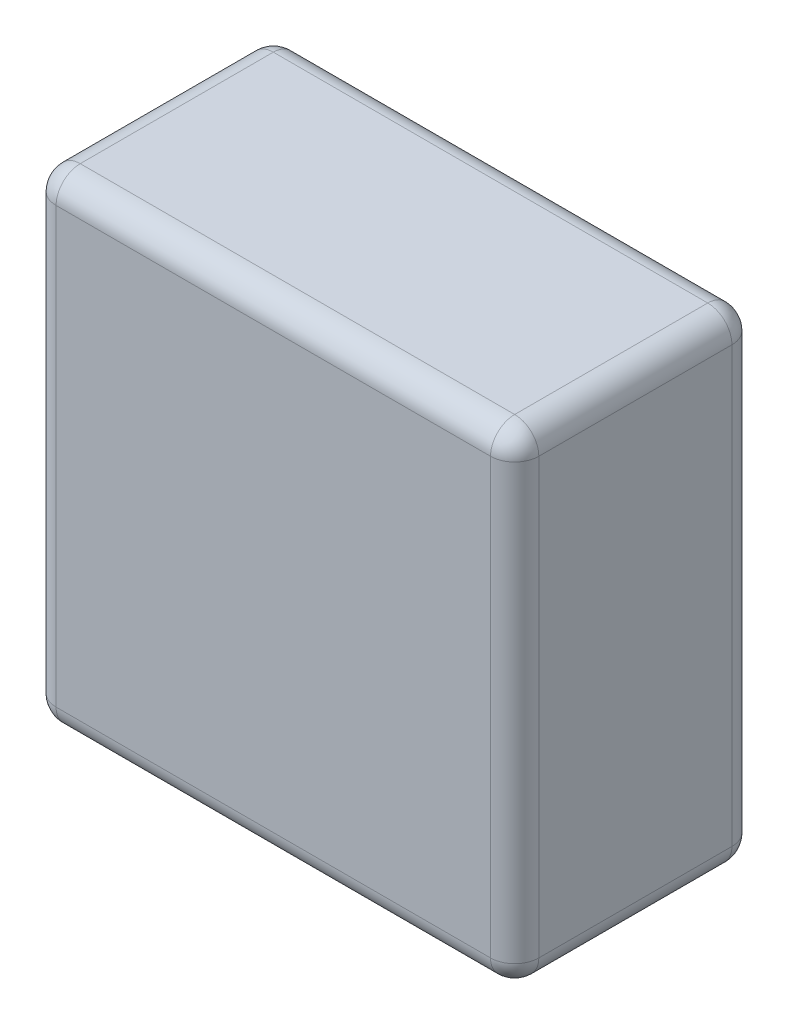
ISO-10303-21;
HEADER;
FILE_DESCRIPTION(('STEP AP214'),'2;1');
FILE_NAME('part.step','',(''),(''),'','','');
FILE_SCHEMA(('AUTOMOTIVE_DESIGN { 1 0 10303 214 1 1 1 1 }'));
ENDSEC;
DATA;
#1=APPLICATION_CONTEXT('core data for automotive mechanical design processes');
#2=APPLICATION_PROTOCOL_DEFINITION('international standard','automotive_design',2000,#1);
#3=PRODUCT_CONTEXT('',#1,'mechanical');
#4=PRODUCT('Part','Part','',(#3));
#5=PRODUCT_RELATED_PRODUCT_CATEGORY('part','',(#4));
#6=PRODUCT_DEFINITION_FORMATION('','',#4);
#7=PRODUCT_DEFINITION_CONTEXT('part definition',#1,'design');
#8=PRODUCT_DEFINITION('design','',#6,#7);
#9=PRODUCT_DEFINITION_SHAPE('','',#8);
#10=(LENGTH_UNIT() NAMED_UNIT(*) SI_UNIT(.MILLI.,.METRE.));
#11=(NAMED_UNIT(*) PLANE_ANGLE_UNIT() SI_UNIT($,.RADIAN.));
#12=(NAMED_UNIT(*) SI_UNIT($,.STERADIAN.) SOLID_ANGLE_UNIT());
#13=UNCERTAINTY_MEASURE_WITH_UNIT(LENGTH_MEASURE(1.E-05),#10,'distance_accuracy_value','');
#14=(GEOMETRIC_REPRESENTATION_CONTEXT(3) GLOBAL_UNCERTAINTY_ASSIGNED_CONTEXT((#13)) GLOBAL_UNIT_ASSIGNED_CONTEXT((#10,
#11,#12)) REPRESENTATION_CONTEXT('',''));
#15=CARTESIAN_POINT('',(0.,0.,0.));
#16=DIRECTION('',(0.,0.,1.));
#17=DIRECTION('',(1.,0.,0.));
#18=AXIS2_PLACEMENT_3D('',#15,#16,#17);
#19=CARTESIAN_POINT('',(-326.4,109.6,100.));
#20=DIRECTION('',(1.,0.,0.));
#21=DIRECTION('',(0.,0.,-1.));
#22=AXIS2_PLACEMENT_3D('',#19,#20,#21);
#23=PLANE('',#22);
#24=DIRECTION('',(0.,-1.,0.));
#25=VECTOR('',#24,1.);
#26=CARTESIAN_POINT('',(-326.4,109.6,9.99999999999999));
#27=LINE('',#26,#25);
#28=CARTESIAN_POINT('',(-326.4,99.6,9.99999999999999));
#29=VERTEX_POINT('',#28);
#30=CARTESIAN_POINT('',(-326.4,-80.4,9.99999999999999));
#31=VERTEX_POINT('',#30);
#32=EDGE_CURVE('E171',#29,#31,#27,.T.);
#33=ORIENTED_EDGE('',*,*,#32,.T.);
#34=DIRECTION('',(0.,0.,-1.));
#35=VECTOR('',#34,1.);
#36=CARTESIAN_POINT('',(-326.4,-80.4,100.));
#37=LINE('',#36,#35);
#38=CARTESIAN_POINT('',(-326.4,-80.4,90.));
#39=VERTEX_POINT('',#38);
#40=EDGE_CURVE('E173',#31,#39,#37,.F.);
#41=ORIENTED_EDGE('',*,*,#40,.T.);
#42=DIRECTION('',(0.,-1.,0.));
#43=VECTOR('',#42,1.);
#44=CARTESIAN_POINT('',(-326.4,109.6,90.));
#45=LINE('',#44,#43);
#46=CARTESIAN_POINT('',(-326.4,99.6,90.));
#47=VERTEX_POINT('',#46);
#48=EDGE_CURVE('E169',#39,#47,#45,.F.);
#49=ORIENTED_EDGE('',*,*,#48,.T.);
#50=DIRECTION('',(0.,0.,-1.));
#51=VECTOR('',#50,1.);
#52=CARTESIAN_POINT('',(-326.4,99.6,100.));
#53=LINE('',#52,#51);
#54=EDGE_CURVE('E167',#47,#29,#53,.T.);
#55=ORIENTED_EDGE('',*,*,#54,.T.);
#56=EDGE_LOOP('',(#33,#41,#49,#55));
#57=FACE_BOUND('',#56,.T.);
#58=ADVANCED_FACE('F33',(#57),#23,.F.);
#59=CARTESIAN_POINT('',(-326.4,-90.4,100.));
#60=DIRECTION('',(0.,1.,0.));
#61=DIRECTION('',(0.,0.,1.));
#62=AXIS2_PLACEMENT_3D('',#59,#60,#61);
#63=PLANE('',#62);
#64=DIRECTION('',(0.,0.,-1.));
#65=VECTOR('',#64,1.);
#66=CARTESIAN_POINT('',(-316.4,-90.4,100.));
#67=LINE('',#66,#65);
#68=CARTESIAN_POINT('',(-316.4,-90.4,90.));
#69=VERTEX_POINT('',#68);
#70=CARTESIAN_POINT('',(-316.4,-90.4,9.99999999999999));
#71=VERTEX_POINT('',#70);
#72=EDGE_CURVE('E154',#69,#71,#67,.T.);
#73=ORIENTED_EDGE('',*,*,#72,.T.);
#74=DIRECTION('',(1.,0.,0.));
#75=VECTOR('',#74,1.);
#76=CARTESIAN_POINT('',(-326.4,-90.4,9.99999999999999));
#77=LINE('',#76,#75);
#78=CARTESIAN_POINT('',(-136.4,-90.4,9.99999999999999));
#79=VERTEX_POINT('',#78);
#80=EDGE_CURVE('E126',#71,#79,#77,.T.);
#81=ORIENTED_EDGE('',*,*,#80,.T.);
#82=DIRECTION('',(0.,0.,-1.));
#83=VECTOR('',#82,1.);
#84=CARTESIAN_POINT('',(-136.4,-90.4,100.));
#85=LINE('',#84,#83);
#86=CARTESIAN_POINT('',(-136.4,-90.4,90.));
#87=VERTEX_POINT('',#86);
#88=EDGE_CURVE('E144',#79,#87,#85,.F.);
#89=ORIENTED_EDGE('',*,*,#88,.T.);
#90=DIRECTION('',(1.,0.,0.));
#91=VECTOR('',#90,1.);
#92=CARTESIAN_POINT('',(-326.4,-90.4,90.));
#93=LINE('',#92,#91);
#94=EDGE_CURVE('E150',#87,#69,#93,.F.);
#95=ORIENTED_EDGE('',*,*,#94,.T.);
#96=EDGE_LOOP('',(#73,#81,#89,#95));
#97=FACE_BOUND('',#96,.T.);
#98=ADVANCED_FACE('F152',(#97),#63,.F.);
#99=CARTESIAN_POINT('',(-126.4,109.6,100.));
#100=DIRECTION('',(-1.,0.,0.));
#101=DIRECTION('',(0.,0.,1.));
#102=AXIS2_PLACEMENT_3D('',#99,#100,#101);
#103=PLANE('',#102);
#104=DIRECTION('',(0.,1.,0.));
#105=VECTOR('',#104,1.);
#106=CARTESIAN_POINT('',(-126.4,-90.4,90.));
#107=LINE('',#106,#105);
#108=CARTESIAN_POINT('',(-126.4,99.6,90.));
#109=VERTEX_POINT('',#108);
#110=CARTESIAN_POINT('',(-126.4,-80.4,90.));
#111=VERTEX_POINT('',#110);
#112=EDGE_CURVE('E189',#109,#111,#107,.F.);
#113=ORIENTED_EDGE('',*,*,#112,.T.);
#114=DIRECTION('',(0.,0.,-1.));
#115=VECTOR('',#114,1.);
#116=CARTESIAN_POINT('',(-126.4,-80.4,100.));
#117=LINE('',#116,#115);
#118=CARTESIAN_POINT('',(-126.4,-80.4,9.99999999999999));
#119=VERTEX_POINT('',#118);
#120=EDGE_CURVE('E191',#111,#119,#117,.T.);
#121=ORIENTED_EDGE('',*,*,#120,.T.);
#122=DIRECTION('',(0.,1.,0.));
#123=VECTOR('',#122,1.);
#124=CARTESIAN_POINT('',(-126.4,109.6,9.99999999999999));
#125=LINE('',#124,#123);
#126=CARTESIAN_POINT('',(-126.4,99.6,9.99999999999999));
#127=VERTEX_POINT('',#126);
#128=EDGE_CURVE('E187',#119,#127,#125,.T.);
#129=ORIENTED_EDGE('',*,*,#128,.T.);
#130=DIRECTION('',(0.,0.,-1.));
#131=VECTOR('',#130,1.);
#132=CARTESIAN_POINT('',(-126.4,99.6,100.));
#133=LINE('',#132,#131);
#134=EDGE_CURVE('E185',#127,#109,#133,.F.);
#135=ORIENTED_EDGE('',*,*,#134,.T.);
#136=EDGE_LOOP('',(#113,#121,#129,#135));
#137=FACE_BOUND('',#136,.T.);
#138=ADVANCED_FACE('F329',(#137),#103,.F.);
#139=CARTESIAN_POINT('',(-326.4,109.6,100.));
#140=DIRECTION('',(0.,-1.,0.));
#141=DIRECTION('',(0.,0.,-1.));
#142=AXIS2_PLACEMENT_3D('',#139,#140,#141);
#143=PLANE('',#142);
#144=DIRECTION('',(-1.,0.,0.));
#145=VECTOR('',#144,1.);
#146=CARTESIAN_POINT('',(-126.4,109.6,90.));
#147=LINE('',#146,#145);
#148=CARTESIAN_POINT('',(-316.4,109.6,90.));
#149=VERTEX_POINT('',#148);
#150=CARTESIAN_POINT('',(-136.4,109.6,90.));
#151=VERTEX_POINT('',#150);
#152=EDGE_CURVE('E42',#149,#151,#147,.F.);
#153=ORIENTED_EDGE('',*,*,#152,.T.);
#154=DIRECTION('',(0.,0.,-1.));
#155=VECTOR('',#154,1.);
#156=CARTESIAN_POINT('',(-136.4,109.6,100.));
#157=LINE('',#156,#155);
#158=CARTESIAN_POINT('',(-136.4,109.6,9.99999999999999));
#159=VERTEX_POINT('',#158);
#160=EDGE_CURVE('E11',#151,#159,#157,.T.);
#161=ORIENTED_EDGE('',*,*,#160,.T.);
#162=DIRECTION('',(-1.,0.,0.));
#163=VECTOR('',#162,1.);
#164=CARTESIAN_POINT('',(-326.4,109.6,9.99999999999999));
#165=LINE('',#164,#163);
#166=CARTESIAN_POINT('',(-316.4,109.6,9.99999999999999));
#167=VERTEX_POINT('',#166);
#168=EDGE_CURVE('E194',#159,#167,#165,.T.);
#169=ORIENTED_EDGE('',*,*,#168,.T.);
#170=DIRECTION('',(0.,0.,-1.));
#171=VECTOR('',#170,1.);
#172=CARTESIAN_POINT('',(-316.4,109.6,100.));
#173=LINE('',#172,#171);
#174=EDGE_CURVE('E53',#167,#149,#173,.F.);
#175=ORIENTED_EDGE('',*,*,#174,.T.);
#176=EDGE_LOOP('',(#153,#161,#169,#175));
#177=FACE_BOUND('',#176,.T.);
#178=ADVANCED_FACE('F295',(#177),#143,.F.);
#179=CARTESIAN_POINT('',(0.,0.,100.));
#180=DIRECTION('',(0.,0.,1.));
#181=DIRECTION('',(1.,0.,0.));
#182=AXIS2_PLACEMENT_3D('',#179,#180,#181);
#183=PLANE('',#182);
#184=DIRECTION('',(0.,-1.,0.));
#185=VECTOR('',#184,1.);
#186=CARTESIAN_POINT('',(-316.4,-90.4,100.));
#187=LINE('',#186,#185);
#188=CARTESIAN_POINT('',(-316.4,99.6,100.));
#189=VERTEX_POINT('',#188);
#190=CARTESIAN_POINT('',(-316.4,-80.4,100.));
#191=VERTEX_POINT('',#190);
#192=EDGE_CURVE('E180',#189,#191,#187,.T.);
#193=ORIENTED_EDGE('',*,*,#192,.T.);
#194=DIRECTION('',(1.,0.,0.));
#195=VECTOR('',#194,1.);
#196=CARTESIAN_POINT('',(-126.4,-80.4,100.));
#197=LINE('',#196,#195);
#198=CARTESIAN_POINT('',(-136.4,-80.4,100.));
#199=VERTEX_POINT('',#198);
#200=EDGE_CURVE('E182',#191,#199,#197,.T.);
#201=ORIENTED_EDGE('',*,*,#200,.T.);
#202=DIRECTION('',(0.,1.,0.));
#203=VECTOR('',#202,1.);
#204=CARTESIAN_POINT('',(-136.4,109.6,100.));
#205=LINE('',#204,#203);
#206=CARTESIAN_POINT('',(-136.4,99.6,100.));
#207=VERTEX_POINT('',#206);
#208=EDGE_CURVE('E178',#199,#207,#205,.T.);
#209=ORIENTED_EDGE('',*,*,#208,.T.);
#210=DIRECTION('',(-1.,0.,0.));
#211=VECTOR('',#210,1.);
#212=CARTESIAN_POINT('',(-326.4,99.6,100.));
#213=LINE('',#212,#211);
#214=EDGE_CURVE('E176',#207,#189,#213,.T.);
#215=ORIENTED_EDGE('',*,*,#214,.T.);
#216=EDGE_LOOP('',(#193,#201,#209,#215));
#217=FACE_BOUND('',#216,.T.);
#218=ADVANCED_FACE('F276',(#217),#183,.T.);
#219=CARTESIAN_POINT('',(0.,0.,0.));
#220=DIRECTION('',(0.,0.,1.));
#221=DIRECTION('',(1.,0.,0.));
#222=AXIS2_PLACEMENT_3D('',#219,#220,#221);
#223=PLANE('',#222);
#224=DIRECTION('',(0.,1.,0.));
#225=VECTOR('',#224,1.);
#226=CARTESIAN_POINT('',(-136.4,0.,0.));
#227=LINE('',#226,#225);
#228=CARTESIAN_POINT('',(-136.4,99.6,0.));
#229=VERTEX_POINT('',#228);
#230=CARTESIAN_POINT('',(-136.4,-80.4,0.));
#231=VERTEX_POINT('',#230);
#232=EDGE_CURVE('E158',#229,#231,#227,.F.);
#233=ORIENTED_EDGE('',*,*,#232,.T.);
#234=DIRECTION('',(1.,0.,0.));
#235=VECTOR('',#234,1.);
#236=CARTESIAN_POINT('',(0.,-80.4,0.));
#237=LINE('',#236,#235);
#238=CARTESIAN_POINT('',(-316.4,-80.4,0.));
#239=VERTEX_POINT('',#238);
#240=EDGE_CURVE('E128',#231,#239,#237,.F.);
#241=ORIENTED_EDGE('',*,*,#240,.T.);
#242=DIRECTION('',(0.,-1.,0.));
#243=VECTOR('',#242,1.);
#244=CARTESIAN_POINT('',(-316.4,0.,0.));
#245=LINE('',#244,#243);
#246=CARTESIAN_POINT('',(-316.4,99.6,0.));
#247=VERTEX_POINT('',#246);
#248=EDGE_CURVE('E164',#239,#247,#245,.F.);
#249=ORIENTED_EDGE('',*,*,#248,.T.);
#250=DIRECTION('',(-1.,0.,0.));
#251=VECTOR('',#250,1.);
#252=CARTESIAN_POINT('',(0.,99.6,0.));
#253=LINE('',#252,#251);
#254=EDGE_CURVE('E156',#247,#229,#253,.F.);
#255=ORIENTED_EDGE('',*,*,#254,.T.);
#256=EDGE_LOOP('',(#233,#241,#249,#255));
#257=FACE_BOUND('',#256,.T.);
#258=ADVANCED_FACE('F355',(#257),#223,.F.);
#259=CARTESIAN_POINT('',(0.,99.6,90.));
#260=DIRECTION('',(1.,0.,0.));
#261=DIRECTION('',(0.,0.,-1.));
#262=AXIS2_PLACEMENT_3D('',#259,#260,#261);
#263=CYLINDRICAL_SURFACE('',#262,10.);
#264=CARTESIAN_POINT('',(-316.4,99.6,90.));
#265=DIRECTION('',(-1.,0.,0.));
#266=DIRECTION('',(0.,0.,1.));
#267=AXIS2_PLACEMENT_3D('',#264,#265,#266);
#268=CIRCLE('',#267,10.);
#269=EDGE_CURVE('E37',#189,#149,#268,.T.);
#270=ORIENTED_EDGE('',*,*,#269,.F.);
#271=ORIENTED_EDGE('',*,*,#214,.F.);
#272=CARTESIAN_POINT('',(-136.4,99.6,90.));
#273=DIRECTION('',(1.,0.,0.));
#274=DIRECTION('',(0.,0.,-1.));
#275=AXIS2_PLACEMENT_3D('',#272,#273,#274);
#276=CIRCLE('',#275,10.);
#277=EDGE_CURVE('E247',#151,#207,#276,.T.);
#278=ORIENTED_EDGE('',*,*,#277,.F.);
#279=ORIENTED_EDGE('',*,*,#152,.F.);
#280=EDGE_LOOP('',(#270,#271,#278,#279));
#281=FACE_BOUND('',#280,.T.);
#282=ADVANCED_FACE('F35',(#281),#263,.T.);
#283=CARTESIAN_POINT('',(-316.4,99.6,90.));
#284=DIRECTION('',(0.,0.,1.));
#285=DIRECTION('',(1.,0.,0.));
#286=AXIS2_PLACEMENT_3D('',#283,#284,#285);
#287=SPHERICAL_SURFACE('',#286,10.);
#288=CARTESIAN_POINT('',(-316.4,99.6,90.));
#289=DIRECTION('',(0.,1.,0.));
#290=DIRECTION('',(0.,0.,1.));
#291=AXIS2_PLACEMENT_3D('',#288,#289,#290);
#292=CIRCLE('',#291,10.);
#293=EDGE_CURVE('E242',#189,#47,#292,.F.);
#294=ORIENTED_EDGE('',*,*,#293,.F.);
#295=ORIENTED_EDGE('',*,*,#269,.T.);
#296=CARTESIAN_POINT('',(-316.4,99.6,90.));
#297=DIRECTION('',(0.,0.,1.));
#298=DIRECTION('',(1.,0.,0.));
#299=AXIS2_PLACEMENT_3D('',#296,#297,#298);
#300=CIRCLE('',#299,10.);
#301=EDGE_CURVE('E245',#47,#149,#300,.F.);
#302=ORIENTED_EDGE('',*,*,#301,.F.);
#303=EDGE_LOOP('',(#294,#295,#302));
#304=FACE_BOUND('',#303,.T.);
#305=ADVANCED_FACE('F257',(#304),#287,.T.);
#306=CARTESIAN_POINT('',(-136.4,99.6,90.));
#307=DIRECTION('',(0.,0.,1.));
#308=DIRECTION('',(1.,0.,0.));
#309=AXIS2_PLACEMENT_3D('',#306,#307,#308);
#310=SPHERICAL_SURFACE('',#309,10.);
#311=CARTESIAN_POINT('',(-136.4,99.6,90.));
#312=DIRECTION('',(0.,0.,1.));
#313=DIRECTION('',(1.,0.,0.));
#314=AXIS2_PLACEMENT_3D('',#311,#312,#313);
#315=CIRCLE('',#314,10.);
#316=EDGE_CURVE('E236',#151,#109,#315,.F.);
#317=ORIENTED_EDGE('',*,*,#316,.F.);
#318=ORIENTED_EDGE('',*,*,#277,.T.);
#319=CARTESIAN_POINT('',(-136.4,99.6,90.));
#320=DIRECTION('',(0.,1.,0.));
#321=DIRECTION('',(0.,0.,1.));
#322=AXIS2_PLACEMENT_3D('',#319,#320,#321);
#323=CIRCLE('',#322,10.);
#324=EDGE_CURVE('E239',#109,#207,#323,.F.);
#325=ORIENTED_EDGE('',*,*,#324,.F.);
#326=EDGE_LOOP('',(#317,#318,#325));
#327=FACE_BOUND('',#326,.T.);
#328=ADVANCED_FACE('F289',(#327),#310,.T.);
#329=CARTESIAN_POINT('',(-316.4,99.6,100.));
#330=DIRECTION('',(0.,0.,-1.));
#331=DIRECTION('',(-1.,0.,0.));
#332=AXIS2_PLACEMENT_3D('',#329,#330,#331);
#333=CYLINDRICAL_SURFACE('',#332,10.);
#334=ORIENTED_EDGE('',*,*,#301,.T.);
#335=ORIENTED_EDGE('',*,*,#174,.F.);
#336=CARTESIAN_POINT('',(-316.4,99.6,9.99999999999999));
#337=DIRECTION('',(0.,0.,-1.));
#338=DIRECTION('',(-1.,0.,0.));
#339=AXIS2_PLACEMENT_3D('',#336,#337,#338);
#340=CIRCLE('',#339,10.);
#341=EDGE_CURVE('E230',#29,#167,#340,.T.);
#342=ORIENTED_EDGE('',*,*,#341,.F.);
#343=ORIENTED_EDGE('',*,*,#54,.F.);
#344=EDGE_LOOP('',(#334,#335,#342,#343));
#345=FACE_BOUND('',#344,.T.);
#346=ADVANCED_FACE('F263',(#345),#333,.T.);
#347=CARTESIAN_POINT('',(-316.4,0.,90.));
#348=DIRECTION('',(0.,1.,0.));
#349=DIRECTION('',(0.,0.,1.));
#350=AXIS2_PLACEMENT_3D('',#347,#348,#349);
#351=CYLINDRICAL_SURFACE('',#350,10.);
#352=ORIENTED_EDGE('',*,*,#293,.T.);
#353=ORIENTED_EDGE('',*,*,#48,.F.);
#354=CARTESIAN_POINT('',(-316.4,-80.4,90.));
#355=DIRECTION('',(0.,-1.,0.));
#356=DIRECTION('',(0.,0.,-1.));
#357=AXIS2_PLACEMENT_3D('',#354,#355,#356);
#358=CIRCLE('',#357,10.);
#359=EDGE_CURVE('E227',#191,#39,#358,.T.);
#360=ORIENTED_EDGE('',*,*,#359,.F.);
#361=ORIENTED_EDGE('',*,*,#192,.F.);
#362=EDGE_LOOP('',(#352,#353,#360,#361));
#363=FACE_BOUND('',#362,.T.);
#364=ADVANCED_FACE('F273',(#363),#351,.T.);
#365=CARTESIAN_POINT('',(0.,-80.4,90.));
#366=DIRECTION('',(-1.,0.,0.));
#367=DIRECTION('',(0.,0.,1.));
#368=AXIS2_PLACEMENT_3D('',#365,#366,#367);
#369=CYLINDRICAL_SURFACE('',#368,10.);
#370=CARTESIAN_POINT('',(-136.4,-80.4,90.));
#371=DIRECTION('',(1.,0.,0.));
#372=DIRECTION('',(0.,0.,-1.));
#373=AXIS2_PLACEMENT_3D('',#370,#371,#372);
#374=CIRCLE('',#373,10.);
#375=EDGE_CURVE('E221',#199,#87,#374,.T.);
#376=ORIENTED_EDGE('',*,*,#375,.F.);
#377=ORIENTED_EDGE('',*,*,#200,.F.);
#378=CARTESIAN_POINT('',(-316.4,-80.4,90.));
#379=DIRECTION('',(-1.,0.,0.));
#380=DIRECTION('',(0.,0.,1.));
#381=AXIS2_PLACEMENT_3D('',#378,#379,#380);
#382=CIRCLE('',#381,10.);
#383=EDGE_CURVE('E224',#69,#191,#382,.T.);
#384=ORIENTED_EDGE('',*,*,#383,.F.);
#385=ORIENTED_EDGE('',*,*,#94,.F.);
#386=EDGE_LOOP('',(#376,#377,#384,#385));
#387=FACE_BOUND('',#386,.T.);
#388=ADVANCED_FACE('F280',(#387),#369,.T.);
#389=CARTESIAN_POINT('',(-136.4,0.,90.));
#390=DIRECTION('',(0.,-1.,0.));
#391=DIRECTION('',(0.,0.,-1.));
#392=AXIS2_PLACEMENT_3D('',#389,#390,#391);
#393=CYLINDRICAL_SURFACE('',#392,10.);
#394=ORIENTED_EDGE('',*,*,#324,.T.);
#395=ORIENTED_EDGE('',*,*,#208,.F.);
#396=CARTESIAN_POINT('',(-136.4,-80.4,90.));
#397=DIRECTION('',(0.,-1.,0.));
#398=DIRECTION('',(0.,0.,-1.));
#399=AXIS2_PLACEMENT_3D('',#396,#397,#398);
#400=CIRCLE('',#399,10.);
#401=EDGE_CURVE('E219',#111,#199,#400,.T.);
#402=ORIENTED_EDGE('',*,*,#401,.F.);
#403=ORIENTED_EDGE('',*,*,#112,.F.);
#404=EDGE_LOOP('',(#394,#395,#402,#403));
#405=FACE_BOUND('',#404,.T.);
#406=ADVANCED_FACE('F286',(#405),#393,.T.);
#407=CARTESIAN_POINT('',(-136.4,99.6,100.));
#408=DIRECTION('',(0.,0.,-1.));
#409=DIRECTION('',(-1.,0.,0.));
#410=AXIS2_PLACEMENT_3D('',#407,#408,#409);
#411=CYLINDRICAL_SURFACE('',#410,10.);
#412=ORIENTED_EDGE('',*,*,#316,.T.);
#413=ORIENTED_EDGE('',*,*,#134,.F.);
#414=CARTESIAN_POINT('',(-136.4,99.6,9.99999999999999));
#415=DIRECTION('',(0.,0.,-1.));
#416=DIRECTION('',(-1.,0.,0.));
#417=AXIS2_PLACEMENT_3D('',#414,#415,#416);
#418=CIRCLE('',#417,10.);
#419=EDGE_CURVE('E216',#159,#127,#418,.T.);
#420=ORIENTED_EDGE('',*,*,#419,.F.);
#421=ORIENTED_EDGE('',*,*,#160,.F.);
#422=EDGE_LOOP('',(#412,#413,#420,#421));
#423=FACE_BOUND('',#422,.T.);
#424=ADVANCED_FACE('F293',(#423),#411,.T.);
#425=CARTESIAN_POINT('',(-326.4,99.6,9.99999999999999));
#426=DIRECTION('',(-1.,0.,0.));
#427=DIRECTION('',(0.,0.,1.));
#428=AXIS2_PLACEMENT_3D('',#425,#426,#427);
#429=CYLINDRICAL_SURFACE('',#428,10.);
#430=CARTESIAN_POINT('',(-316.4,99.6,9.99999999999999));
#431=DIRECTION('',(-1.,0.,0.));
#432=DIRECTION('',(0.,0.,1.));
#433=AXIS2_PLACEMENT_3D('',#430,#431,#432);
#434=CIRCLE('',#433,10.);
#435=EDGE_CURVE('E233',#167,#247,#434,.T.);
#436=ORIENTED_EDGE('',*,*,#435,.F.);
#437=ORIENTED_EDGE('',*,*,#168,.F.);
#438=CARTESIAN_POINT('',(-136.4,99.6,10.));
#439=DIRECTION('',(1.,0.,0.));
#440=DIRECTION('',(0.,0.,-1.));
#441=AXIS2_PLACEMENT_3D('',#438,#439,#440);
#442=CIRCLE('',#441,10.);
#443=EDGE_CURVE('E214',#229,#159,#442,.T.);
#444=ORIENTED_EDGE('',*,*,#443,.F.);
#445=ORIENTED_EDGE('',*,*,#254,.F.);
#446=EDGE_LOOP('',(#436,#437,#444,#445));
#447=FACE_BOUND('',#446,.T.);
#448=ADVANCED_FACE('F298',(#447),#429,.T.);
#449=CARTESIAN_POINT('',(-316.4,99.6,10.));
#450=DIRECTION('',(0.,0.,1.));
#451=DIRECTION('',(1.,0.,0.));
#452=AXIS2_PLACEMENT_3D('',#449,#450,#451);
#453=SPHERICAL_SURFACE('',#452,10.);
#454=ORIENTED_EDGE('',*,*,#341,.T.);
#455=ORIENTED_EDGE('',*,*,#435,.T.);
#456=CARTESIAN_POINT('',(-316.4,99.6,10.));
#457=DIRECTION('',(0.,1.,0.));
#458=DIRECTION('',(0.,0.,1.));
#459=AXIS2_PLACEMENT_3D('',#456,#457,#458);
#460=CIRCLE('',#459,10.);
#461=EDGE_CURVE('E211',#29,#247,#460,.F.);
#462=ORIENTED_EDGE('',*,*,#461,.F.);
#463=EDGE_LOOP('',(#454,#455,#462));
#464=FACE_BOUND('',#463,.T.);
#465=ADVANCED_FACE('F302',(#464),#453,.T.);
#466=CARTESIAN_POINT('',(-316.4,-80.4,90.));
#467=DIRECTION('',(0.,0.,1.));
#468=DIRECTION('',(1.,0.,0.));
#469=AXIS2_PLACEMENT_3D('',#466,#467,#468);
#470=SPHERICAL_SURFACE('',#469,10.);
#471=ORIENTED_EDGE('',*,*,#383,.T.);
#472=ORIENTED_EDGE('',*,*,#359,.T.);
#473=CARTESIAN_POINT('',(-316.4,-80.4,90.));
#474=DIRECTION('',(0.,0.,1.));
#475=DIRECTION('',(1.,0.,0.));
#476=AXIS2_PLACEMENT_3D('',#473,#474,#475);
#477=CIRCLE('',#476,10.);
#478=EDGE_CURVE('E209',#69,#39,#477,.F.);
#479=ORIENTED_EDGE('',*,*,#478,.F.);
#480=EDGE_LOOP('',(#471,#472,#479));
#481=FACE_BOUND('',#480,.T.);
#482=ADVANCED_FACE('F313',(#481),#470,.T.);
#483=CARTESIAN_POINT('',(-136.4,-80.4,90.));
#484=DIRECTION('',(0.,0.,1.));
#485=DIRECTION('',(1.,0.,0.));
#486=AXIS2_PLACEMENT_3D('',#483,#484,#485);
#487=SPHERICAL_SURFACE('',#486,10.);
#488=ORIENTED_EDGE('',*,*,#401,.T.);
#489=ORIENTED_EDGE('',*,*,#375,.T.);
#490=CARTESIAN_POINT('',(-136.4,-80.4,90.));
#491=DIRECTION('',(0.,0.,1.));
#492=DIRECTION('',(1.,0.,0.));
#493=AXIS2_PLACEMENT_3D('',#490,#491,#492);
#494=CIRCLE('',#493,10.);
#495=EDGE_CURVE('E147',#111,#87,#494,.F.);
#496=ORIENTED_EDGE('',*,*,#495,.F.);
#497=EDGE_LOOP('',(#488,#489,#496));
#498=FACE_BOUND('',#497,.T.);
#499=ADVANCED_FACE('F315',(#498),#487,.T.);
#500=CARTESIAN_POINT('',(-136.4,99.6,10.));
#501=DIRECTION('',(0.,0.,1.));
#502=DIRECTION('',(1.,0.,0.));
#503=AXIS2_PLACEMENT_3D('',#500,#501,#502);
#504=SPHERICAL_SURFACE('',#503,10.);
#505=ORIENTED_EDGE('',*,*,#443,.T.);
#506=ORIENTED_EDGE('',*,*,#419,.T.);
#507=CARTESIAN_POINT('',(-136.4,99.6,9.99999999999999));
#508=DIRECTION('',(0.,1.,0.));
#509=DIRECTION('',(0.,0.,1.));
#510=AXIS2_PLACEMENT_3D('',#507,#508,#509);
#511=CIRCLE('',#510,10.);
#512=EDGE_CURVE('E205',#229,#127,#511,.F.);
#513=ORIENTED_EDGE('',*,*,#512,.F.);
#514=EDGE_LOOP('',(#505,#506,#513));
#515=FACE_BOUND('',#514,.T.);
#516=ADVANCED_FACE('F321',(#515),#504,.T.);
#517=CARTESIAN_POINT('',(-316.4,109.6,9.99999999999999));
#518=DIRECTION('',(0.,-1.,0.));
#519=DIRECTION('',(0.,0.,-1.));
#520=AXIS2_PLACEMENT_3D('',#517,#518,#519);
#521=CYLINDRICAL_SURFACE('',#520,10.);
#522=ORIENTED_EDGE('',*,*,#461,.T.);
#523=ORIENTED_EDGE('',*,*,#248,.F.);
#524=CARTESIAN_POINT('',(-316.4,-80.4,9.99999999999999));
#525=DIRECTION('',(0.,-1.,0.));
#526=DIRECTION('',(0.,0.,-1.));
#527=AXIS2_PLACEMENT_3D('',#524,#525,#526);
#528=CIRCLE('',#527,10.);
#529=EDGE_CURVE('E202',#31,#239,#528,.T.);
#530=ORIENTED_EDGE('',*,*,#529,.F.);
#531=ORIENTED_EDGE('',*,*,#32,.F.);
#532=EDGE_LOOP('',(#522,#523,#530,#531));
#533=FACE_BOUND('',#532,.T.);
#534=ADVANCED_FACE('F306',(#533),#521,.T.);
#535=CARTESIAN_POINT('',(-316.4,-80.4,100.));
#536=DIRECTION('',(0.,0.,-1.));
#537=DIRECTION('',(-1.,0.,0.));
#538=AXIS2_PLACEMENT_3D('',#535,#536,#537);
#539=CYLINDRICAL_SURFACE('',#538,10.);
#540=ORIENTED_EDGE('',*,*,#478,.T.);
#541=ORIENTED_EDGE('',*,*,#40,.F.);
#542=CARTESIAN_POINT('',(-316.4,-80.4,9.99999999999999));
#543=DIRECTION('',(0.,0.,-1.));
#544=DIRECTION('',(-1.,0.,0.));
#545=AXIS2_PLACEMENT_3D('',#542,#543,#544);
#546=CIRCLE('',#545,10.);
#547=EDGE_CURVE('E141',#71,#31,#546,.T.);
#548=ORIENTED_EDGE('',*,*,#547,.F.);
#549=ORIENTED_EDGE('',*,*,#72,.F.);
#550=EDGE_LOOP('',(#540,#541,#548,#549));
#551=FACE_BOUND('',#550,.T.);
#552=ADVANCED_FACE('F311',(#551),#539,.T.);
#553=CARTESIAN_POINT('',(-136.4,-80.4,100.));
#554=DIRECTION('',(0.,0.,-1.));
#555=DIRECTION('',(-1.,0.,0.));
#556=AXIS2_PLACEMENT_3D('',#553,#554,#555);
#557=CYLINDRICAL_SURFACE('',#556,10.);
#558=ORIENTED_EDGE('',*,*,#495,.T.);
#559=ORIENTED_EDGE('',*,*,#88,.F.);
#560=CARTESIAN_POINT('',(-136.4,-80.4,9.99999999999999));
#561=DIRECTION('',(0.,0.,-1.));
#562=DIRECTION('',(-1.,0.,0.));
#563=AXIS2_PLACEMENT_3D('',#560,#561,#562);
#564=CIRCLE('',#563,10.);
#565=EDGE_CURVE('E133',#119,#79,#564,.T.);
#566=ORIENTED_EDGE('',*,*,#565,.F.);
#567=ORIENTED_EDGE('',*,*,#120,.F.);
#568=EDGE_LOOP('',(#558,#559,#566,#567));
#569=FACE_BOUND('',#568,.T.);
#570=ADVANCED_FACE('F145',(#569),#557,.T.);
#571=CARTESIAN_POINT('',(-136.4,109.6,9.99999999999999));
#572=DIRECTION('',(0.,1.,0.));
#573=DIRECTION('',(0.,0.,1.));
#574=AXIS2_PLACEMENT_3D('',#571,#572,#573);
#575=CYLINDRICAL_SURFACE('',#574,10.);
#576=ORIENTED_EDGE('',*,*,#512,.T.);
#577=ORIENTED_EDGE('',*,*,#128,.F.);
#578=CARTESIAN_POINT('',(-136.4,-80.4,10.));
#579=DIRECTION('',(0.,-1.,0.));
#580=DIRECTION('',(1.,0.,0.));
#581=AXIS2_PLACEMENT_3D('',#578,#579,#580);
#582=CIRCLE('',#581,10.);
#583=EDGE_CURVE('E137',#231,#119,#582,.T.);
#584=ORIENTED_EDGE('',*,*,#583,.F.);
#585=ORIENTED_EDGE('',*,*,#232,.F.);
#586=EDGE_LOOP('',(#576,#577,#584,#585));
#587=FACE_BOUND('',#586,.T.);
#588=ADVANCED_FACE('F339',(#587),#575,.T.);
#589=CARTESIAN_POINT('',(-316.4,-80.4,10.));
#590=DIRECTION('',(0.,0.,1.));
#591=DIRECTION('',(1.,0.,0.));
#592=AXIS2_PLACEMENT_3D('',#589,#590,#591);
#593=SPHERICAL_SURFACE('',#592,10.);
#594=ORIENTED_EDGE('',*,*,#547,.T.);
#595=ORIENTED_EDGE('',*,*,#529,.T.);
#596=CARTESIAN_POINT('',(-316.4,-80.4,10.));
#597=DIRECTION('',(-1.,0.,0.));
#598=DIRECTION('',(0.,0.,1.));
#599=AXIS2_PLACEMENT_3D('',#596,#597,#598);
#600=CIRCLE('',#599,10.);
#601=EDGE_CURVE('E130',#71,#239,#600,.F.);
#602=ORIENTED_EDGE('',*,*,#601,.F.);
#603=EDGE_LOOP('',(#594,#595,#602));
#604=FACE_BOUND('',#603,.T.);
#605=ADVANCED_FACE('F309',(#604),#593,.T.);
#606=CARTESIAN_POINT('',(-136.4,-80.4,10.));
#607=DIRECTION('',(0.,0.,1.));
#608=DIRECTION('',(1.,0.,0.));
#609=AXIS2_PLACEMENT_3D('',#606,#607,#608);
#610=SPHERICAL_SURFACE('',#609,10.);
#611=ORIENTED_EDGE('',*,*,#583,.T.);
#612=ORIENTED_EDGE('',*,*,#565,.T.);
#613=CARTESIAN_POINT('',(-136.4,-80.4,9.99999999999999));
#614=DIRECTION('',(1.,0.,0.));
#615=DIRECTION('',(0.,0.,-1.));
#616=AXIS2_PLACEMENT_3D('',#613,#614,#615);
#617=CIRCLE('',#616,10.);
#618=EDGE_CURVE('E122',#231,#79,#617,.F.);
#619=ORIENTED_EDGE('',*,*,#618,.F.);
#620=EDGE_LOOP('',(#611,#612,#619));
#621=FACE_BOUND('',#620,.T.);
#622=ADVANCED_FACE('F135',(#621),#610,.T.);
#623=CARTESIAN_POINT('',(-326.4,-80.4,9.99999999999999));
#624=DIRECTION('',(1.,0.,0.));
#625=DIRECTION('',(0.,0.,-1.));
#626=AXIS2_PLACEMENT_3D('',#623,#624,#625);
#627=CYLINDRICAL_SURFACE('',#626,10.);
#628=ORIENTED_EDGE('',*,*,#601,.T.);
#629=ORIENTED_EDGE('',*,*,#240,.F.);
#630=ORIENTED_EDGE('',*,*,#618,.T.);
#631=ORIENTED_EDGE('',*,*,#80,.F.);
#632=EDGE_LOOP('',(#628,#629,#630,#631));
#633=FACE_BOUND('',#632,.T.);
#634=ADVANCED_FACE('F124',(#633),#627,.T.);
#635=CLOSED_SHELL('',(#58,#98,#138,#178,#218,#258,#282,#305,#328,#346,#364,#388,#406,#424,#448,
#465,#482,#499,#516,#534,#552,#570,#588,#605,#622,#634));
#636=MANIFOLD_SOLID_BREP('B2',#635);
#637=ADVANCED_BREP_SHAPE_REPRESENTATION('',(#18,#636),#14);
#638=SHAPE_DEFINITION_REPRESENTATION(#9,#637);
ENDSEC;
END-ISO-10303-21;
